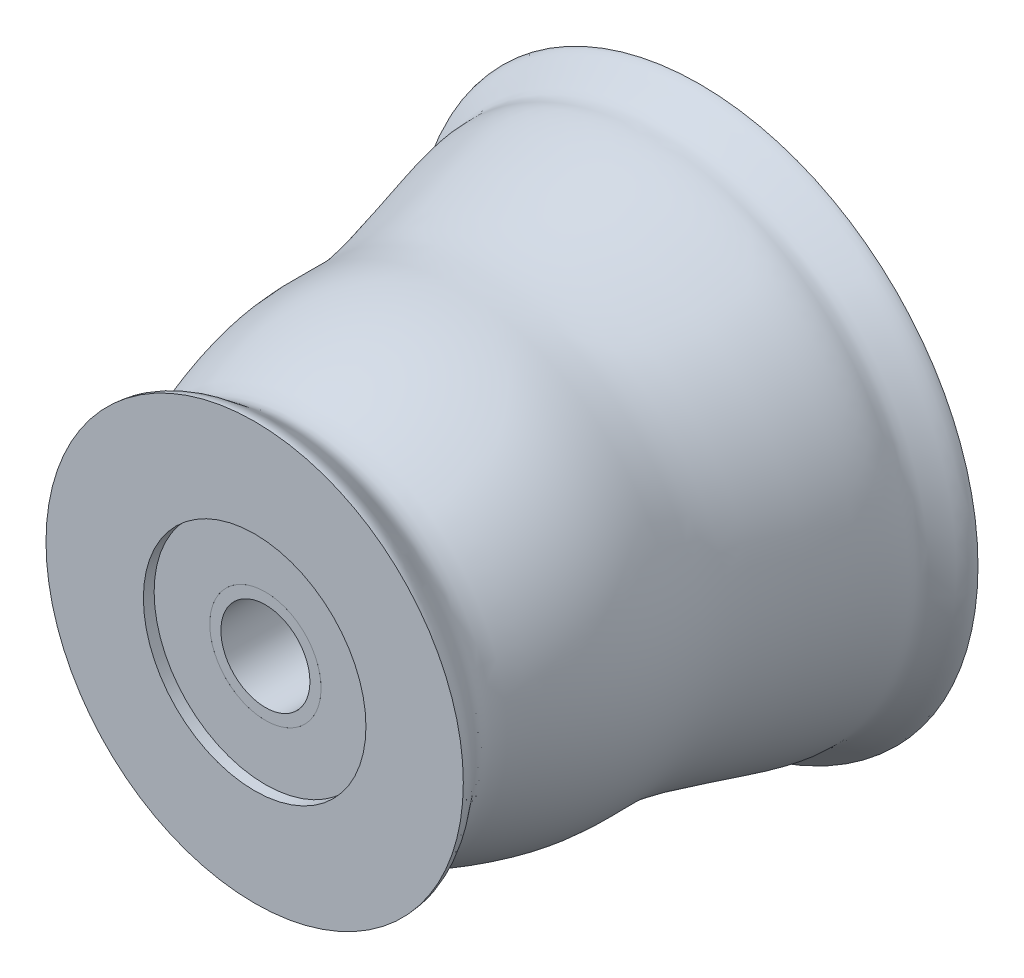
ISO-10303-21;
HEADER;
FILE_DESCRIPTION(('STEP AP214'),'2;1');
FILE_NAME('part.step','',(''),(''),'','','');
FILE_SCHEMA(('AUTOMOTIVE_DESIGN { 1 0 10303 214 1 1 1 1 }'));
ENDSEC;
DATA;
#1=APPLICATION_CONTEXT('core data for automotive mechanical design processes');
#2=APPLICATION_PROTOCOL_DEFINITION('international standard','automotive_design',2000,#1);
#3=PRODUCT_CONTEXT('',#1,'mechanical');
#4=PRODUCT('Part','Part','',(#3));
#5=PRODUCT_RELATED_PRODUCT_CATEGORY('part','',(#4));
#6=PRODUCT_DEFINITION_FORMATION('','',#4);
#7=PRODUCT_DEFINITION_CONTEXT('part definition',#1,'design');
#8=PRODUCT_DEFINITION('design','',#6,#7);
#9=PRODUCT_DEFINITION_SHAPE('','',#8);
#10=(LENGTH_UNIT() NAMED_UNIT(*) SI_UNIT(.MILLI.,.METRE.));
#11=(NAMED_UNIT(*) PLANE_ANGLE_UNIT() SI_UNIT($,.RADIAN.));
#12=(NAMED_UNIT(*) SI_UNIT($,.STERADIAN.) SOLID_ANGLE_UNIT());
#13=UNCERTAINTY_MEASURE_WITH_UNIT(LENGTH_MEASURE(1.E-05),#10,'distance_accuracy_value','');
#14=(GEOMETRIC_REPRESENTATION_CONTEXT(3) GLOBAL_UNCERTAINTY_ASSIGNED_CONTEXT((#13)) GLOBAL_UNIT_ASSIGNED_CONTEXT((#10,
#11,#12)) REPRESENTATION_CONTEXT('',''));
#15=CARTESIAN_POINT('',(0.,0.,0.));
#16=DIRECTION('',(0.,0.,1.));
#17=DIRECTION('',(1.,0.,0.));
#18=AXIS2_PLACEMENT_3D('',#15,#16,#17);
#19=CARTESIAN_POINT('',(0.,0.,-0.00100000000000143));
#20=DIRECTION('',(0.,0.,1.));
#21=DIRECTION('',(1.,0.,0.));
#22=AXIS2_PLACEMENT_3D('',#19,#20,#21);
#23=CYLINDRICAL_SURFACE('',#22,0.499999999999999);
#24=CARTESIAN_POINT('',(0.,0.,0.2));
#25=DIRECTION('',(0.,0.,-1.));
#26=DIRECTION('',(0.,1.,0.));
#27=AXIS2_PLACEMENT_3D('',#24,#25,#26);
#28=CIRCLE('',#27,0.499999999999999);
#29=CARTESIAN_POINT('',(0.,0.499999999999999,0.2));
#30=VERTEX_POINT('',#29);
#31=EDGE_CURVE('E55',#30,#30,#28,.T.);
#32=ORIENTED_EDGE('',*,*,#31,.F.);
#33=EDGE_LOOP('',(#32));
#34=FACE_BOUND('',#33,.T.);
#35=CARTESIAN_POINT('',(0.,0.,3.90337994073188));
#36=DIRECTION('',(0.,0.,1.));
#37=DIRECTION('',(1.,0.,0.));
#38=AXIS2_PLACEMENT_3D('',#35,#36,#37);
#39=CIRCLE('',#38,0.499999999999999);
#40=CARTESIAN_POINT('',(0.499999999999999,0.,3.90337994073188));
#41=VERTEX_POINT('',#40);
#42=EDGE_CURVE('E59',#41,#41,#39,.T.);
#43=ORIENTED_EDGE('',*,*,#42,.F.);
#44=EDGE_LOOP('',(#43));
#45=FACE_BOUND('',#44,.T.);
#46=ADVANCED_FACE('F49',(#34,#45),#23,.T.);
#47=CARTESIAN_POINT('',(0.,0.,3.90337994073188));
#48=DIRECTION('',(0.,0.,1.));
#49=DIRECTION('',(1.,0.,0.));
#50=AXIS2_PLACEMENT_3D('',#47,#48,#49);
#51=PLANE('',#50);
#52=CARTESIAN_POINT('',(0.,0.,3.90337994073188));
#53=DIRECTION('',(0.,0.,1.));
#54=DIRECTION('',(1.,0.,0.));
#55=AXIS2_PLACEMENT_3D('',#52,#53,#54);
#56=CIRCLE('',#55,0.399999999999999);
#57=CARTESIAN_POINT('',(0.399999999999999,0.,3.90337994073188));
#58=VERTEX_POINT('',#57);
#59=EDGE_CURVE('E64',#58,#58,#56,.T.);
#60=ORIENTED_EDGE('',*,*,#59,.F.);
#61=EDGE_LOOP('',(#60));
#62=FACE_BOUND('',#61,.T.);
#63=ORIENTED_EDGE('',*,*,#42,.T.);
#64=EDGE_LOOP('',(#63));
#65=FACE_BOUND('',#64,.T.);
#66=ADVANCED_FACE('F71',(#62,#65),#51,.T.);
#67=CARTESIAN_POINT('',(0.,0.,-0.00100000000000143));
#68=DIRECTION('',(0.,0.,1.));
#69=DIRECTION('',(1.,0.,0.));
#70=AXIS2_PLACEMENT_3D('',#67,#68,#69);
#71=CYLINDRICAL_SURFACE('',#70,0.399999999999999);
#72=CARTESIAN_POINT('',(0.,0.,0.24));
#73=DIRECTION('',(0.,0.,-1.));
#74=DIRECTION('',(0.,1.,0.));
#75=AXIS2_PLACEMENT_3D('',#72,#73,#74);
#76=CIRCLE('',#75,0.399999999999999);
#77=CARTESIAN_POINT('',(0.,0.399999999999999,0.24));
#78=VERTEX_POINT('',#77);
#79=EDGE_CURVE('E11',#78,#78,#76,.T.);
#80=ORIENTED_EDGE('',*,*,#79,.T.);
#81=EDGE_LOOP('',(#80));
#82=FACE_BOUND('',#81,.T.);
#83=ORIENTED_EDGE('',*,*,#59,.T.);
#84=EDGE_LOOP('',(#83));
#85=FACE_BOUND('',#84,.T.);
#86=ADVANCED_FACE('F69',(#82,#85),#71,.F.);
#87=CARTESIAN_POINT('',(0.,0.,0.));
#88=DIRECTION('',(0.,0.,-1.));
#89=DIRECTION('',(0.,1.,0.));
#90=AXIS2_PLACEMENT_3D('',#87,#88,#89);
#91=CONICAL_SURFACE('',#90,1.,1.19028994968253);
#92=ORIENTED_EDGE('',*,*,#31,.T.);
#93=EDGE_LOOP('',(#92));
#94=FACE_BOUND('',#93,.T.);
#95=ORIENTED_EDGE('',*,*,#79,.F.);
#96=EDGE_LOOP('',(#95));
#97=FACE_BOUND('',#96,.T.);
#98=ADVANCED_FACE('F90',(#94,#97),#91,.F.);
#99=CLOSED_SHELL('',(#46,#66,#86,#98));
#100=MANIFOLD_SOLID_BREP('B2',#99);
#101=CARTESIAN_POINT('',(0.,1.875,4.));
#102=CARTESIAN_POINT('',(0.,1.875,3.8647344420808));
#103=CARTESIAN_POINT('',(0.,1.600326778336,3.71322489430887));
#104=CARTESIAN_POINT('',(0.,1.96004359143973,2.8232172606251));
#105=CARTESIAN_POINT('',(0.,1.99361103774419,2.38972143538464));
#106=CARTESIAN_POINT('',(0.,1.95895541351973,1.61516820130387));
#107=CARTESIAN_POINT('',(0.,2.32940290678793,0.598255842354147));
#108=CARTESIAN_POINT('',(0.,2.27603692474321,0.253593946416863));
#109=CARTESIAN_POINT('',(0.,2.5,0.109261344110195));
#110=CARTESIAN_POINT('',(0.,2.5,0.));
#111=B_SPLINE_CURVE_WITH_KNOTS('',3,(#101,#102,#103,#104,#105,#106,#107,#108,#109,#110),
.UNSPECIFIED.,.F.,.F.,(4,1,1,1,1,1,1,4),(0.,0.0648401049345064,0.106377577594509,
0.381041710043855,0.449702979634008,0.724329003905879,0.782791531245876,1.),.UNSPECIFIED.);
#112=CARTESIAN_POINT('',(0.,0.,0.));
#113=DIRECTION('',(0.,0.,-1.));
#114=AXIS1_PLACEMENT('',#112,#113);
#115=SURFACE_OF_REVOLUTION('',#111,#114);
#116=CARTESIAN_POINT('',(0.,0.,0.));
#117=DIRECTION('',(0.,0.,-1.));
#118=DIRECTION('',(0.,1.,0.));
#119=AXIS2_PLACEMENT_3D('',#116,#117,#118);
#120=CIRCLE('',#119,2.5);
#121=CARTESIAN_POINT('',(0.,2.5,0.));
#122=VERTEX_POINT('',#121);
#123=EDGE_CURVE('E143',#122,#122,#120,.T.);
#124=ORIENTED_EDGE('',*,*,#123,.F.);
#125=EDGE_LOOP('',(#124));
#126=FACE_BOUND('',#125,.T.);
#127=CARTESIAN_POINT('',(0.,0.,4.));
#128=DIRECTION('',(0.,0.,-1.));
#129=DIRECTION('',(0.,1.,0.));
#130=AXIS2_PLACEMENT_3D('',#127,#128,#129);
#131=CIRCLE('',#130,1.875);
#132=CARTESIAN_POINT('',(0.,1.875,4.));
#133=VERTEX_POINT('',#132);
#134=EDGE_CURVE('E48',#133,#133,#131,.T.);
#135=ORIENTED_EDGE('',*,*,#134,.T.);
#136=EDGE_LOOP('',(#135));
#137=FACE_BOUND('',#136,.T.);
#138=ADVANCED_FACE('F111',(#126,#137),#115,.T.);
#139=CARTESIAN_POINT('',(0.,0.,4.));
#140=DIRECTION('',(0.,0.,1.));
#141=DIRECTION('',(0.,-1.,0.));
#142=AXIS2_PLACEMENT_3D('',#139,#140,#141);
#143=PLANE('',#142);
#144=CARTESIAN_POINT('',(0.,0.,4.));
#145=DIRECTION('',(0.,0.,-1.));
#146=DIRECTION('',(0.,1.,0.));
#147=AXIS2_PLACEMENT_3D('',#144,#145,#146);
#148=CIRCLE('',#147,0.999999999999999);
#149=CARTESIAN_POINT('',(0.,0.999999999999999,4.));
#150=VERTEX_POINT('',#149);
#151=EDGE_CURVE('E119',#150,#150,#148,.T.);
#152=ORIENTED_EDGE('',*,*,#151,.T.);
#153=EDGE_LOOP('',(#152));
#154=FACE_BOUND('',#153,.T.);
#155=ORIENTED_EDGE('',*,*,#134,.F.);
#156=EDGE_LOOP('',(#155));
#157=FACE_BOUND('',#156,.T.);
#158=ADVANCED_FACE('F158',(#154,#157),#143,.T.);
#159=CARTESIAN_POINT('',(0.,0.,0.));
#160=DIRECTION('',(0.,0.,-1.));
#161=DIRECTION('',(0.,1.,0.));
#162=AXIS2_PLACEMENT_3D('',#159,#160,#161);
#163=CYLINDRICAL_SURFACE('',#162,0.999999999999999);
#164=CARTESIAN_POINT('',(0.,0.,3.90337994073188));
#165=DIRECTION('',(0.,0.,-1.));
#166=DIRECTION('',(0.,1.,0.));
#167=AXIS2_PLACEMENT_3D('',#164,#165,#166);
#168=CIRCLE('',#167,0.999999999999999);
#169=CARTESIAN_POINT('',(0.,0.999999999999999,3.90337994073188));
#170=VERTEX_POINT('',#169);
#171=EDGE_CURVE('E124',#170,#170,#168,.T.);
#172=ORIENTED_EDGE('',*,*,#171,.T.);
#173=EDGE_LOOP('',(#172));
#174=FACE_BOUND('',#173,.T.);
#175=ORIENTED_EDGE('',*,*,#151,.F.);
#176=EDGE_LOOP('',(#175));
#177=FACE_BOUND('',#176,.T.);
#178=ADVANCED_FACE('F162',(#174,#177),#163,.F.);
#179=CARTESIAN_POINT('',(0.,0.,3.90337994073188));
#180=DIRECTION('',(0.,0.,1.));
#181=DIRECTION('',(0.,-1.,0.));
#182=AXIS2_PLACEMENT_3D('',#179,#180,#181);
#183=PLANE('',#182);
#184=CARTESIAN_POINT('',(0.,0.,3.90337994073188));
#185=DIRECTION('',(0.,0.,-1.));
#186=DIRECTION('',(0.,1.,0.));
#187=AXIS2_PLACEMENT_3D('',#184,#185,#186);
#188=CIRCLE('',#187,0.499999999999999);
#189=CARTESIAN_POINT('',(0.,0.499999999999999,3.90337994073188));
#190=VERTEX_POINT('',#189);
#191=EDGE_CURVE('E129',#190,#190,#188,.T.);
#192=ORIENTED_EDGE('',*,*,#191,.T.);
#193=EDGE_LOOP('',(#192));
#194=FACE_BOUND('',#193,.T.);
#195=ORIENTED_EDGE('',*,*,#171,.F.);
#196=EDGE_LOOP('',(#195));
#197=FACE_BOUND('',#196,.T.);
#198=ADVANCED_FACE('F166',(#194,#197),#183,.T.);
#199=CARTESIAN_POINT('',(0.,0.,0.));
#200=DIRECTION('',(0.,0.,-1.));
#201=DIRECTION('',(0.,1.,0.));
#202=AXIS2_PLACEMENT_3D('',#199,#200,#201);
#203=CYLINDRICAL_SURFACE('',#202,0.5);
#204=ORIENTED_EDGE('',*,*,#191,.F.);
#205=EDGE_LOOP('',(#204));
#206=FACE_BOUND('',#205,.T.);
#207=CARTESIAN_POINT('',(0.,0.,0.2));
#208=DIRECTION('',(0.,0.,-1.));
#209=DIRECTION('',(0.,1.,0.));
#210=AXIS2_PLACEMENT_3D('',#207,#208,#209);
#211=CIRCLE('',#210,0.5);
#212=CARTESIAN_POINT('',(0.,0.5,0.2));
#213=VERTEX_POINT('',#212);
#214=EDGE_CURVE('E135',#213,#213,#211,.T.);
#215=ORIENTED_EDGE('',*,*,#214,.T.);
#216=EDGE_LOOP('',(#215));
#217=FACE_BOUND('',#216,.T.);
#218=ADVANCED_FACE('F173',(#206,#217),#203,.F.);
#219=CARTESIAN_POINT('',(0.,0.,0.));
#220=DIRECTION('',(0.,0.,-1.));
#221=DIRECTION('',(0.,1.,0.));
#222=AXIS2_PLACEMENT_3D('',#219,#220,#221);
#223=CONICAL_SURFACE('',#222,1.,1.19028994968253);
#224=ORIENTED_EDGE('',*,*,#214,.F.);
#225=EDGE_LOOP('',(#224));
#226=FACE_BOUND('',#225,.T.);
#227=CARTESIAN_POINT('',(0.,0.,0.));
#228=DIRECTION('',(0.,0.,-1.));
#229=DIRECTION('',(0.,1.,0.));
#230=AXIS2_PLACEMENT_3D('',#227,#228,#229);
#231=CIRCLE('',#230,1.);
#232=CARTESIAN_POINT('',(0.,1.,0.));
#233=VERTEX_POINT('',#232);
#234=EDGE_CURVE('E139',#233,#233,#231,.T.);
#235=ORIENTED_EDGE('',*,*,#234,.T.);
#236=EDGE_LOOP('',(#235));
#237=FACE_BOUND('',#236,.T.);
#238=ADVANCED_FACE('F177',(#226,#237),#223,.F.);
#239=CARTESIAN_POINT('',(0.,0.,0.));
#240=DIRECTION('',(0.,0.,-1.));
#241=DIRECTION('',(0.,1.,0.));
#242=AXIS2_PLACEMENT_3D('',#239,#240,#241);
#243=PLANE('',#242);
#244=ORIENTED_EDGE('',*,*,#123,.T.);
#245=EDGE_LOOP('',(#244));
#246=FACE_BOUND('',#245,.T.);
#247=ORIENTED_EDGE('',*,*,#234,.F.);
#248=EDGE_LOOP('',(#247));
#249=FACE_BOUND('',#248,.T.);
#250=ADVANCED_FACE('F154',(#246,#249),#243,.T.);
#251=CLOSED_SHELL('',(#138,#158,#178,#198,#218,#238,#250));
#252=MANIFOLD_SOLID_BREP('B6',#251);
#253=ADVANCED_BREP_SHAPE_REPRESENTATION('',(#18,#100,#252),#14);
#254=SHAPE_DEFINITION_REPRESENTATION(#9,#253);
ENDSEC;
END-ISO-10303-21;
